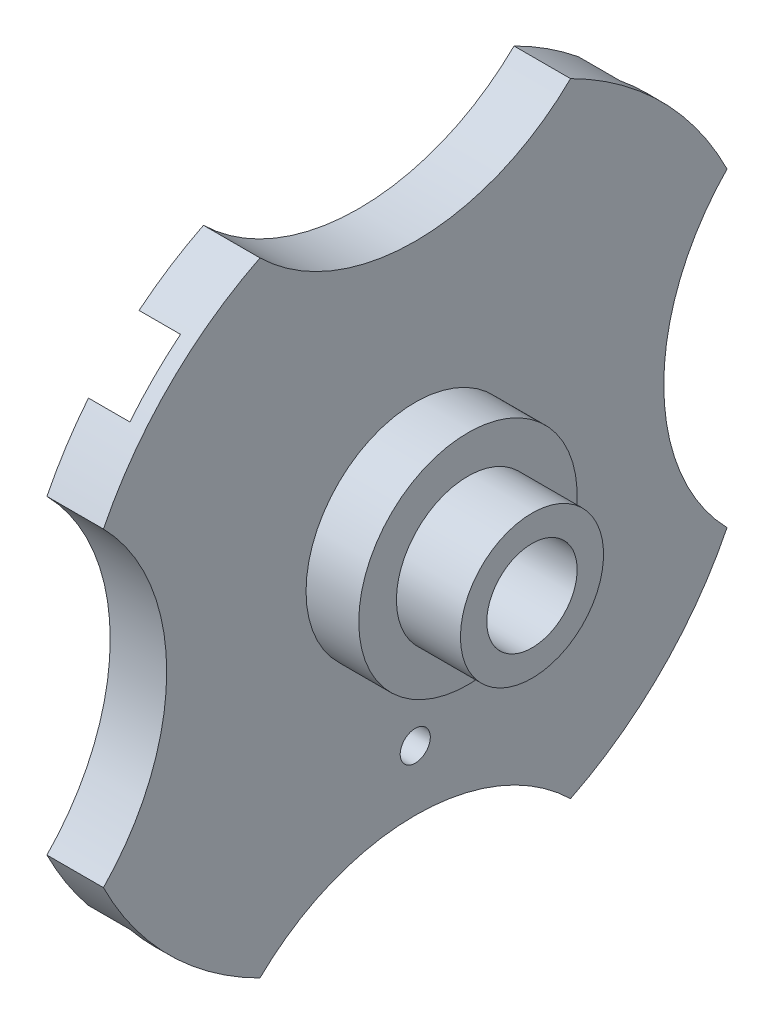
ISO-10303-21;
HEADER;
FILE_DESCRIPTION(('STEP AP214'),'2;1');
FILE_NAME('part.step','',(''),(''),'','','');
FILE_SCHEMA(('AUTOMOTIVE_DESIGN { 1 0 10303 214 1 1 1 1 }'));
ENDSEC;
DATA;
#1=APPLICATION_CONTEXT('core data for automotive mechanical design processes');
#2=APPLICATION_PROTOCOL_DEFINITION('international standard','automotive_design',2000,#1);
#3=PRODUCT_CONTEXT('',#1,'mechanical');
#4=PRODUCT('Part','Part','',(#3));
#5=PRODUCT_RELATED_PRODUCT_CATEGORY('part','',(#4));
#6=PRODUCT_DEFINITION_FORMATION('','',#4);
#7=PRODUCT_DEFINITION_CONTEXT('part definition',#1,'design');
#8=PRODUCT_DEFINITION('design','',#6,#7);
#9=PRODUCT_DEFINITION_SHAPE('','',#8);
#10=(LENGTH_UNIT() NAMED_UNIT(*) SI_UNIT(.MILLI.,.METRE.));
#11=(NAMED_UNIT(*) PLANE_ANGLE_UNIT() SI_UNIT($,.RADIAN.));
#12=(NAMED_UNIT(*) SI_UNIT($,.STERADIAN.) SOLID_ANGLE_UNIT());
#13=UNCERTAINTY_MEASURE_WITH_UNIT(LENGTH_MEASURE(1.E-05),#10,'distance_accuracy_value','');
#14=(GEOMETRIC_REPRESENTATION_CONTEXT(3) GLOBAL_UNCERTAINTY_ASSIGNED_CONTEXT((#13)) GLOBAL_UNIT_ASSIGNED_CONTEXT((#10,
#11,#12)) REPRESENTATION_CONTEXT('',''));
#15=CARTESIAN_POINT('',(0.,0.,0.));
#16=DIRECTION('',(0.,0.,1.));
#17=DIRECTION('',(1.,0.,0.));
#18=AXIS2_PLACEMENT_3D('',#15,#16,#17);
#19=CARTESIAN_POINT('',(0.,0.,0.));
#20=DIRECTION('',(-1.,0.,0.));
#21=DIRECTION('',(0.,0.,1.));
#22=AXIS2_PLACEMENT_3D('',#19,#20,#21);
#23=CYLINDRICAL_SURFACE('',#22,92.5);
#24=CARTESIAN_POINT('',(11.,0.,0.));
#25=DIRECTION('',(-1.,0.,0.));
#26=DIRECTION('',(0.,0.,1.));
#27=AXIS2_PLACEMENT_3D('',#24,#25,#26);
#28=CIRCLE('',#27,92.5);
#29=CARTESIAN_POINT('',(11.,-58.3439949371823,-71.779023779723));
#30=VERTEX_POINT('',#29);
#31=CARTESIAN_POINT('',(11.,-71.7790237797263,-58.3439949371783));
#32=VERTEX_POINT('',#31);
#33=EDGE_CURVE('E199',#30,#32,#28,.T.);
#34=ORIENTED_EDGE('',*,*,#33,.F.);
#35=DIRECTION('',(-1.,0.,0.));
#36=VECTOR('',#35,1.);
#37=CARTESIAN_POINT('',(0.,-58.3439949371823,-71.779023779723));
#38=LINE('',#37,#36);
#39=CARTESIAN_POINT('',(0.,-58.3439949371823,-71.779023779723));
#40=VERTEX_POINT('',#39);
#41=EDGE_CURVE('E250',#30,#40,#38,.T.);
#42=ORIENTED_EDGE('',*,*,#41,.T.);
#43=CARTESIAN_POINT('',(0.,0.,0.));
#44=DIRECTION('',(-1.,0.,0.));
#45=DIRECTION('',(0.,0.,1.));
#46=AXIS2_PLACEMENT_3D('',#43,#44,#45);
#47=CIRCLE('',#46,92.5);
#48=CARTESIAN_POINT('',(0.,-41.2340199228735,-82.8010000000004));
#49=VERTEX_POINT('',#48);
#50=EDGE_CURVE('E407',#49,#40,#47,.T.);
#51=ORIENTED_EDGE('',*,*,#50,.F.);
#52=DIRECTION('',(-1.,0.,0.));
#53=VECTOR('',#52,1.);
#54=CARTESIAN_POINT('',(23.,-41.2340199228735,-82.8010000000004));
#55=LINE('',#54,#53);
#56=CARTESIAN_POINT('',(15.,-41.2340199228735,-82.8010000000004));
#57=VERTEX_POINT('',#56);
#58=EDGE_CURVE('E312',#49,#57,#55,.F.);
#59=ORIENTED_EDGE('',*,*,#58,.T.);
#60=CARTESIAN_POINT('',(15.,0.,0.));
#61=DIRECTION('',(-1.,0.,0.));
#62=DIRECTION('',(0.,0.,1.));
#63=AXIS2_PLACEMENT_3D('',#60,#61,#62);
#64=CIRCLE('',#63,92.5);
#65=CARTESIAN_POINT('',(15.,-82.8009999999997,-41.2340199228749));
#66=VERTEX_POINT('',#65);
#67=EDGE_CURVE('E385',#57,#66,#64,.T.);
#68=ORIENTED_EDGE('',*,*,#67,.T.);
#69=DIRECTION('',(-1.,0.,0.));
#70=VECTOR('',#69,1.);
#71=CARTESIAN_POINT('',(23.,-82.8009999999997,-41.2340199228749));
#72=LINE('',#71,#70);
#73=CARTESIAN_POINT('',(0.,-82.8009999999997,-41.2340199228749));
#74=VERTEX_POINT('',#73);
#75=EDGE_CURVE('E321',#66,#74,#72,.T.);
#76=ORIENTED_EDGE('',*,*,#75,.T.);
#77=CARTESIAN_POINT('',(0.,-71.7790237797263,-58.3439949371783));
#78=VERTEX_POINT('',#77);
#79=EDGE_CURVE('E404',#78,#74,#47,.T.);
#80=ORIENTED_EDGE('',*,*,#79,.F.);
#81=DIRECTION('',(-1.,0.,0.));
#82=VECTOR('',#81,1.);
#83=CARTESIAN_POINT('',(0.,-71.7790237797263,-58.3439949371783));
#84=LINE('',#83,#82);
#85=EDGE_CURVE('E55',#78,#32,#84,.F.);
#86=ORIENTED_EDGE('',*,*,#85,.T.);
#87=EDGE_LOOP('',(#34,#42,#51,#59,#68,#76,#80,#86));
#88=FACE_BOUND('',#87,.T.);
#89=ADVANCED_FACE('F32',(#88),#23,.T.);
#90=CARTESIAN_POINT('',(11.,0.,0.));
#91=DIRECTION('',(-1.,0.,0.));
#92=DIRECTION('',(0.,0.,1.));
#93=AXIS2_PLACEMENT_3D('',#90,#91,#92);
#94=CIRCLE('',#93,92.5);
#95=CARTESIAN_POINT('',(11.,-71.7803426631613,58.3423723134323));
#96=VERTEX_POINT('',#95);
#97=CARTESIAN_POINT('',(11.,-58.3456175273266,71.7777048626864));
#98=VERTEX_POINT('',#97);
#99=EDGE_CURVE('E391',#96,#98,#94,.T.);
#100=ORIENTED_EDGE('',*,*,#99,.F.);
#101=DIRECTION('',(-1.,0.,0.));
#102=VECTOR('',#101,1.);
#103=CARTESIAN_POINT('',(0.,-71.7803426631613,58.3423723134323));
#104=LINE('',#103,#102);
#105=CARTESIAN_POINT('',(0.,-71.7803426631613,58.3423723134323));
#106=VERTEX_POINT('',#105);
#107=EDGE_CURVE('E274',#96,#106,#104,.T.);
#108=ORIENTED_EDGE('',*,*,#107,.T.);
#109=CARTESIAN_POINT('',(0.,-82.8010000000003,41.2340199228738));
#110=VERTEX_POINT('',#109);
#111=EDGE_CURVE('E408',#110,#106,#47,.T.);
#112=ORIENTED_EDGE('',*,*,#111,.F.);
#113=DIRECTION('',(-1.,0.,0.));
#114=VECTOR('',#113,1.);
#115=CARTESIAN_POINT('',(23.,-82.8010000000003,41.2340199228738));
#116=LINE('',#115,#114);
#117=CARTESIAN_POINT('',(15.,-82.8010000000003,41.2340199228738));
#118=VERTEX_POINT('',#117);
#119=EDGE_CURVE('E324',#110,#118,#116,.F.);
#120=ORIENTED_EDGE('',*,*,#119,.T.);
#121=CARTESIAN_POINT('',(15.,-41.2340199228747,82.8009999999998));
#122=VERTEX_POINT('',#121);
#123=EDGE_CURVE('E479',#118,#122,#64,.T.);
#124=ORIENTED_EDGE('',*,*,#123,.T.);
#125=DIRECTION('',(-1.,0.,0.));
#126=VECTOR('',#125,1.);
#127=CARTESIAN_POINT('',(23.,-41.2340199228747,82.8009999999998));
#128=LINE('',#127,#126);
#129=CARTESIAN_POINT('',(0.,-41.2340199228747,82.8009999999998));
#130=VERTEX_POINT('',#129);
#131=EDGE_CURVE('E333',#122,#130,#128,.T.);
#132=ORIENTED_EDGE('',*,*,#131,.T.);
#133=CARTESIAN_POINT('',(0.,-58.3456175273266,71.7777048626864));
#134=VERTEX_POINT('',#133);
#135=EDGE_CURVE('E409',#134,#130,#47,.T.);
#136=ORIENTED_EDGE('',*,*,#135,.F.);
#137=DIRECTION('',(-1.,0.,0.));
#138=VECTOR('',#137,1.);
#139=CARTESIAN_POINT('',(0.,-58.3456175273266,71.7777048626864));
#140=LINE('',#139,#138);
#141=EDGE_CURVE('E269',#134,#98,#140,.F.);
#142=ORIENTED_EDGE('',*,*,#141,.T.);
#143=EDGE_LOOP('',(#100,#108,#112,#120,#124,#132,#136,#142));
#144=FACE_BOUND('',#143,.T.);
#145=ADVANCED_FACE('F444',(#144),#23,.T.);
#146=CARTESIAN_POINT('',(11.,0.,0.));
#147=DIRECTION('',(-1.,0.,0.));
#148=DIRECTION('',(0.,0.,1.));
#149=AXIS2_PLACEMENT_3D('',#146,#147,#148);
#150=CIRCLE('',#149,92.5);
#151=CARTESIAN_POINT('',(11.,58.3439949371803,71.7790237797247));
#152=VERTEX_POINT('',#151);
#153=CARTESIAN_POINT('',(11.,71.7790237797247,58.3439949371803));
#154=VERTEX_POINT('',#153);
#155=EDGE_CURVE('E285',#152,#154,#150,.T.);
#156=ORIENTED_EDGE('',*,*,#155,.F.);
#157=DIRECTION('',(-1.,0.,0.));
#158=VECTOR('',#157,1.);
#159=CARTESIAN_POINT('',(11.,58.3439949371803,71.7790237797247));
#160=LINE('',#159,#158);
#161=CARTESIAN_POINT('',(0.,58.3439949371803,71.7790237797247));
#162=VERTEX_POINT('',#161);
#163=EDGE_CURVE('E298',#152,#162,#160,.T.);
#164=ORIENTED_EDGE('',*,*,#163,.T.);
#165=CARTESIAN_POINT('',(0.,41.2340199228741,82.8010000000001));
#166=VERTEX_POINT('',#165);
#167=EDGE_CURVE('E356',#166,#162,#47,.T.);
#168=ORIENTED_EDGE('',*,*,#167,.F.);
#169=DIRECTION('',(-1.,0.,0.));
#170=VECTOR('',#169,1.);
#171=CARTESIAN_POINT('',(23.,41.2340199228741,82.8010000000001));
#172=LINE('',#171,#170);
#173=CARTESIAN_POINT('',(15.,41.2340199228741,82.8010000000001));
#174=VERTEX_POINT('',#173);
#175=EDGE_CURVE('E336',#166,#174,#172,.F.);
#176=ORIENTED_EDGE('',*,*,#175,.T.);
#177=CARTESIAN_POINT('',(15.,82.801,41.2340199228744));
#178=VERTEX_POINT('',#177);
#179=EDGE_CURVE('E380',#174,#178,#64,.T.);
#180=ORIENTED_EDGE('',*,*,#179,.T.);
#181=DIRECTION('',(-1.,0.,0.));
#182=VECTOR('',#181,1.);
#183=CARTESIAN_POINT('',(23.,82.801,41.2340199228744));
#184=LINE('',#183,#182);
#185=CARTESIAN_POINT('',(0.,82.801,41.2340199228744));
#186=VERTEX_POINT('',#185);
#187=EDGE_CURVE('E345',#178,#186,#184,.T.);
#188=ORIENTED_EDGE('',*,*,#187,.T.);
#189=CARTESIAN_POINT('',(0.,71.7790237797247,58.3439949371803));
#190=VERTEX_POINT('',#189);
#191=EDGE_CURVE('E351',#190,#186,#47,.T.);
#192=ORIENTED_EDGE('',*,*,#191,.F.);
#193=DIRECTION('',(-1.,0.,0.));
#194=VECTOR('',#193,1.);
#195=CARTESIAN_POINT('',(11.,71.7790237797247,58.3439949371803));
#196=LINE('',#195,#194);
#197=EDGE_CURVE('E297',#154,#190,#196,.T.);
#198=ORIENTED_EDGE('',*,*,#197,.F.);
#199=EDGE_LOOP('',(#156,#164,#168,#176,#180,#188,#192,#198));
#200=FACE_BOUND('',#199,.T.);
#201=ADVANCED_FACE('F448',(#200),#23,.T.);
#202=CARTESIAN_POINT('',(11.,0.,0.));
#203=DIRECTION('',(-1.,0.,0.));
#204=DIRECTION('',(0.,0.,1.));
#205=AXIS2_PLACEMENT_3D('',#202,#203,#204);
#206=CIRCLE('',#205,92.5);
#207=CARTESIAN_POINT('',(11.,71.7777048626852,-58.3456175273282));
#208=VERTEX_POINT('',#207);
#209=CARTESIAN_POINT('',(11.,58.3423723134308,-71.7803426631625));
#210=VERTEX_POINT('',#209);
#211=EDGE_CURVE('E11',#208,#210,#206,.T.);
#212=ORIENTED_EDGE('',*,*,#211,.F.);
#213=DIRECTION('',(-1.,0.,0.));
#214=VECTOR('',#213,1.);
#215=CARTESIAN_POINT('',(0.,71.7777048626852,-58.3456175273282));
#216=LINE('',#215,#214);
#217=CARTESIAN_POINT('',(0.,71.7777048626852,-58.3456175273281));
#218=VERTEX_POINT('',#217);
#219=EDGE_CURVE('E228',#208,#218,#216,.T.);
#220=ORIENTED_EDGE('',*,*,#219,.T.);
#221=CARTESIAN_POINT('',(0.,82.801,-41.2340199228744));
#222=VERTEX_POINT('',#221);
#223=EDGE_CURVE('E352',#222,#218,#47,.T.);
#224=ORIENTED_EDGE('',*,*,#223,.F.);
#225=DIRECTION('',(-1.,0.,0.));
#226=VECTOR('',#225,1.);
#227=CARTESIAN_POINT('',(23.,82.801,-41.2340199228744));
#228=LINE('',#227,#226);
#229=CARTESIAN_POINT('',(15.,82.801,-41.2340199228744));
#230=VERTEX_POINT('',#229);
#231=EDGE_CURVE('E348',#222,#230,#228,.F.);
#232=ORIENTED_EDGE('',*,*,#231,.T.);
#233=CARTESIAN_POINT('',(15.,41.2340199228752,-82.8009999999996));
#234=VERTEX_POINT('',#233);
#235=EDGE_CURVE('E381',#230,#234,#64,.T.);
#236=ORIENTED_EDGE('',*,*,#235,.T.);
#237=DIRECTION('',(-1.,0.,0.));
#238=VECTOR('',#237,1.);
#239=CARTESIAN_POINT('',(23.,41.2340199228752,-82.8009999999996));
#240=LINE('',#239,#238);
#241=CARTESIAN_POINT('',(0.,41.2340199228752,-82.8009999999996));
#242=VERTEX_POINT('',#241);
#243=EDGE_CURVE('E309',#234,#242,#240,.T.);
#244=ORIENTED_EDGE('',*,*,#243,.T.);
#245=CARTESIAN_POINT('',(0.,58.3423723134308,-71.7803426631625));
#246=VERTEX_POINT('',#245);
#247=EDGE_CURVE('E355',#246,#242,#47,.T.);
#248=ORIENTED_EDGE('',*,*,#247,.F.);
#249=DIRECTION('',(-1.,0.,0.));
#250=VECTOR('',#249,1.);
#251=CARTESIAN_POINT('',(0.,58.3423723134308,-71.7803426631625));
#252=LINE('',#251,#250);
#253=EDGE_CURVE('E47',#246,#210,#252,.F.);
#254=ORIENTED_EDGE('',*,*,#253,.T.);
#255=EDGE_LOOP('',(#212,#220,#224,#232,#236,#244,#248,#254));
#256=FACE_BOUND('',#255,.T.);
#257=ADVANCED_FACE('F34',(#256),#23,.T.);
#258=CARTESIAN_POINT('',(15.,92.5,0.));
#259=DIRECTION('',(-1.,0.,0.));
#260=DIRECTION('',(0.,0.,1.));
#261=AXIS2_PLACEMENT_3D('',#258,#259,#260);
#262=PLANE('',#261);
#263=CARTESIAN_POINT('',(15.,-50.,0.));
#264=DIRECTION('',(-1.,0.,0.));
#265=DIRECTION('',(0.,0.,1.));
#266=AXIS2_PLACEMENT_3D('',#263,#264,#265);
#267=CIRCLE('',#266,4.00000000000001);
#268=CARTESIAN_POINT('',(15.,-50.,4.00000000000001));
#269=VERTEX_POINT('',#268);
#270=EDGE_CURVE('E213',#269,#269,#267,.T.);
#271=ORIENTED_EDGE('',*,*,#270,.T.);
#272=EDGE_LOOP('',(#271));
#273=FACE_BOUND('',#272,.T.);
#274=ORIENTED_EDGE('',*,*,#67,.F.);
#275=CARTESIAN_POINT('',(15.,1.30930626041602E-12,-125.));
#276=DIRECTION('',(-1.,0.,0.));
#277=DIRECTION('',(0.,0.,1.));
#278=AXIS2_PLACEMENT_3D('',#275,#276,#277);
#279=CIRCLE('',#278,59.);
#280=EDGE_CURVE('E301',#57,#234,#279,.T.);
#281=ORIENTED_EDGE('',*,*,#280,.T.);
#282=ORIENTED_EDGE('',*,*,#235,.F.);
#283=CARTESIAN_POINT('',(15.,125.,0.));
#284=DIRECTION('',(-1.,0.,0.));
#285=DIRECTION('',(0.,0.,1.));
#286=AXIS2_PLACEMENT_3D('',#283,#284,#285);
#287=CIRCLE('',#286,59.);
#288=EDGE_CURVE('E342',#230,#178,#287,.T.);
#289=ORIENTED_EDGE('',*,*,#288,.T.);
#290=ORIENTED_EDGE('',*,*,#179,.F.);
#291=CARTESIAN_POINT('',(15.,-4.36435420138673E-13,125.));
#292=DIRECTION('',(-1.,0.,0.));
#293=DIRECTION('',(0.,0.,1.));
#294=AXIS2_PLACEMENT_3D('',#291,#292,#293);
#295=CIRCLE('',#294,59.);
#296=EDGE_CURVE('E330',#174,#122,#295,.T.);
#297=ORIENTED_EDGE('',*,*,#296,.T.);
#298=ORIENTED_EDGE('',*,*,#123,.F.);
#299=CARTESIAN_POINT('',(15.,-125.,-8.72870840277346E-13));
#300=DIRECTION('',(-1.,0.,0.));
#301=DIRECTION('',(0.,0.,1.));
#302=AXIS2_PLACEMENT_3D('',#299,#300,#301);
#303=CIRCLE('',#302,59.);
#304=EDGE_CURVE('E318',#118,#66,#303,.T.);
#305=ORIENTED_EDGE('',*,*,#304,.T.);
#306=EDGE_LOOP('',(#274,#281,#282,#289,#290,#297,#298,#305));
#307=FACE_BOUND('',#306,.T.);
#308=CARTESIAN_POINT('',(15.,0.,0.));
#309=DIRECTION('',(-1.,0.,0.));
#310=DIRECTION('',(0.,0.,1.));
#311=AXIS2_PLACEMENT_3D('',#308,#309,#310);
#312=CIRCLE('',#311,29.);
#313=CARTESIAN_POINT('',(15.,0.,29.));
#314=VERTEX_POINT('',#313);
#315=EDGE_CURVE('E377',#314,#314,#312,.T.);
#316=ORIENTED_EDGE('',*,*,#315,.T.);
#317=EDGE_LOOP('',(#316));
#318=FACE_BOUND('',#317,.T.);
#319=ADVANCED_FACE('F422',(#273,#307,#318),#262,.F.);
#320=CARTESIAN_POINT('',(0.,0.,0.));
#321=DIRECTION('',(-1.,0.,0.));
#322=DIRECTION('',(0.,0.,1.));
#323=AXIS2_PLACEMENT_3D('',#320,#321,#322);
#324=CYLINDRICAL_SURFACE('',#323,29.);
#325=ORIENTED_EDGE('',*,*,#315,.F.);
#326=EDGE_LOOP('',(#325));
#327=FACE_BOUND('',#326,.T.);
#328=CARTESIAN_POINT('',(29.,0.,0.));
#329=DIRECTION('',(-1.,0.,0.));
#330=DIRECTION('',(0.,0.,1.));
#331=AXIS2_PLACEMENT_3D('',#328,#329,#330);
#332=CIRCLE('',#331,29.);
#333=CARTESIAN_POINT('',(29.,0.,29.));
#334=VERTEX_POINT('',#333);
#335=EDGE_CURVE('E374',#334,#334,#332,.T.);
#336=ORIENTED_EDGE('',*,*,#335,.T.);
#337=EDGE_LOOP('',(#336));
#338=FACE_BOUND('',#337,.T.);
#339=ADVANCED_FACE('F455',(#327,#338),#324,.T.);
#340=CARTESIAN_POINT('',(29.,29.,0.));
#341=DIRECTION('',(-1.,0.,0.));
#342=DIRECTION('',(0.,0.,1.));
#343=AXIS2_PLACEMENT_3D('',#340,#341,#342);
#344=PLANE('',#343);
#345=ORIENTED_EDGE('',*,*,#335,.F.);
#346=EDGE_LOOP('',(#345));
#347=FACE_BOUND('',#346,.T.);
#348=CARTESIAN_POINT('',(29.,0.,0.));
#349=DIRECTION('',(-1.,0.,0.));
#350=DIRECTION('',(0.,0.,1.));
#351=AXIS2_PLACEMENT_3D('',#348,#349,#350);
#352=CIRCLE('',#351,19.);
#353=CARTESIAN_POINT('',(29.,0.,19.));
#354=VERTEX_POINT('',#353);
#355=EDGE_CURVE('E371',#354,#354,#352,.T.);
#356=ORIENTED_EDGE('',*,*,#355,.T.);
#357=EDGE_LOOP('',(#356));
#358=FACE_BOUND('',#357,.T.);
#359=ADVANCED_FACE('F521',(#347,#358),#344,.F.);
#360=CARTESIAN_POINT('',(0.,0.,0.));
#361=DIRECTION('',(-1.,0.,0.));
#362=DIRECTION('',(0.,0.,1.));
#363=AXIS2_PLACEMENT_3D('',#360,#361,#362);
#364=CYLINDRICAL_SURFACE('',#363,19.);
#365=ORIENTED_EDGE('',*,*,#355,.F.);
#366=EDGE_LOOP('',(#365));
#367=FACE_BOUND('',#366,.T.);
#368=CARTESIAN_POINT('',(46.,0.,0.));
#369=DIRECTION('',(-1.,0.,0.));
#370=DIRECTION('',(0.,0.,1.));
#371=AXIS2_PLACEMENT_3D('',#368,#369,#370);
#372=CIRCLE('',#371,19.);
#373=CARTESIAN_POINT('',(46.,0.,19.));
#374=VERTEX_POINT('',#373);
#375=EDGE_CURVE('E368',#374,#374,#372,.T.);
#376=ORIENTED_EDGE('',*,*,#375,.T.);
#377=EDGE_LOOP('',(#376));
#378=FACE_BOUND('',#377,.T.);
#379=ADVANCED_FACE('F517',(#367,#378),#364,.T.);
#380=CARTESIAN_POINT('',(46.,19.,0.));
#381=DIRECTION('',(-1.,0.,0.));
#382=DIRECTION('',(0.,0.,1.));
#383=AXIS2_PLACEMENT_3D('',#380,#381,#382);
#384=PLANE('',#383);
#385=ORIENTED_EDGE('',*,*,#375,.F.);
#386=EDGE_LOOP('',(#385));
#387=FACE_BOUND('',#386,.T.);
#388=CARTESIAN_POINT('',(46.,0.,0.));
#389=DIRECTION('',(-1.,0.,0.));
#390=DIRECTION('',(0.,0.,1.));
#391=AXIS2_PLACEMENT_3D('',#388,#389,#390);
#392=CIRCLE('',#391,12.);
#393=CARTESIAN_POINT('',(46.,0.,12.));
#394=VERTEX_POINT('',#393);
#395=EDGE_CURVE('E365',#394,#394,#392,.T.);
#396=ORIENTED_EDGE('',*,*,#395,.T.);
#397=EDGE_LOOP('',(#396));
#398=FACE_BOUND('',#397,.T.);
#399=ADVANCED_FACE('F513',(#387,#398),#384,.F.);
#400=CARTESIAN_POINT('',(0.,0.,0.));
#401=DIRECTION('',(-1.,0.,0.));
#402=DIRECTION('',(0.,0.,1.));
#403=AXIS2_PLACEMENT_3D('',#400,#401,#402);
#404=CYLINDRICAL_SURFACE('',#403,12.);
#405=ORIENTED_EDGE('',*,*,#395,.F.);
#406=EDGE_LOOP('',(#405));
#407=FACE_BOUND('',#406,.T.);
#408=CARTESIAN_POINT('',(17.,0.,0.));
#409=DIRECTION('',(-1.,0.,0.));
#410=DIRECTION('',(0.,0.,1.));
#411=AXIS2_PLACEMENT_3D('',#408,#409,#410);
#412=CIRCLE('',#411,12.);
#413=CARTESIAN_POINT('',(17.,0.,12.));
#414=VERTEX_POINT('',#413);
#415=EDGE_CURVE('E362',#414,#414,#412,.T.);
#416=ORIENTED_EDGE('',*,*,#415,.T.);
#417=EDGE_LOOP('',(#416));
#418=FACE_BOUND('',#417,.T.);
#419=ADVANCED_FACE('F509',(#407,#418),#404,.F.);
#420=CARTESIAN_POINT('',(17.,24.,0.));
#421=DIRECTION('',(1.,0.,0.));
#422=DIRECTION('',(0.,0.,-1.));
#423=AXIS2_PLACEMENT_3D('',#420,#421,#422);
#424=PLANE('',#423);
#425=ORIENTED_EDGE('',*,*,#415,.F.);
#426=EDGE_LOOP('',(#425));
#427=FACE_BOUND('',#426,.T.);
#428=CARTESIAN_POINT('',(17.,0.,0.));
#429=DIRECTION('',(-1.,0.,0.));
#430=DIRECTION('',(0.,0.,1.));
#431=AXIS2_PLACEMENT_3D('',#428,#429,#430);
#432=CIRCLE('',#431,24.);
#433=CARTESIAN_POINT('',(17.,0.,24.));
#434=VERTEX_POINT('',#433);
#435=EDGE_CURVE('E359',#434,#434,#432,.T.);
#436=ORIENTED_EDGE('',*,*,#435,.T.);
#437=EDGE_LOOP('',(#436));
#438=FACE_BOUND('',#437,.T.);
#439=ADVANCED_FACE('F505',(#427,#438),#424,.F.);
#440=CARTESIAN_POINT('',(0.,0.,0.));
#441=DIRECTION('',(-1.,0.,0.));
#442=DIRECTION('',(0.,0.,1.));
#443=AXIS2_PLACEMENT_3D('',#440,#441,#442);
#444=CYLINDRICAL_SURFACE('',#443,24.);
#445=ORIENTED_EDGE('',*,*,#435,.F.);
#446=EDGE_LOOP('',(#445));
#447=FACE_BOUND('',#446,.T.);
#448=CARTESIAN_POINT('',(0.,0.,0.));
#449=DIRECTION('',(-1.,0.,0.));
#450=DIRECTION('',(0.,0.,1.));
#451=AXIS2_PLACEMENT_3D('',#448,#449,#450);
#452=CIRCLE('',#451,24.);
#453=CARTESIAN_POINT('',(0.,0.,24.));
#454=VERTEX_POINT('',#453);
#455=EDGE_CURVE('E354',#454,#454,#452,.T.);
#456=ORIENTED_EDGE('',*,*,#455,.T.);
#457=EDGE_LOOP('',(#456));
#458=FACE_BOUND('',#457,.T.);
#459=ADVANCED_FACE('F501',(#447,#458),#444,.F.);
#460=CARTESIAN_POINT('',(0.,24.,0.));
#461=DIRECTION('',(1.,0.,0.));
#462=DIRECTION('',(0.,0.,-1.));
#463=AXIS2_PLACEMENT_3D('',#460,#461,#462);
#464=PLANE('',#463);
#465=CARTESIAN_POINT('',(0.,-50.,0.));
#466=DIRECTION('',(-1.,0.,0.));
#467=DIRECTION('',(0.,0.,1.));
#468=AXIS2_PLACEMENT_3D('',#465,#466,#467);
#469=CIRCLE('',#468,4.00000000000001);
#470=CARTESIAN_POINT('',(0.,-50.,4.00000000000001));
#471=VERTEX_POINT('',#470);
#472=EDGE_CURVE('E218',#471,#471,#469,.T.);
#473=ORIENTED_EDGE('',*,*,#472,.F.);
#474=EDGE_LOOP('',(#473));
#475=FACE_BOUND('',#474,.T.);
#476=ORIENTED_EDGE('',*,*,#455,.F.);
#477=EDGE_LOOP('',(#476));
#478=FACE_BOUND('',#477,.T.);
#479=ORIENTED_EDGE('',*,*,#223,.T.);
#480=DIRECTION('',(0.,0.70710678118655,-0.707106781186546));
#481=VECTOR('',#480,1.);
#482=CARTESIAN_POINT('',(0.,32.1733585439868,-18.74127120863));
#483=LINE('',#482,#481);
#484=CARTESIAN_POINT('',(0.,32.1733585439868,-18.7412712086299));
#485=VERTEX_POINT('',#484);
#486=EDGE_CURVE('E212',#485,#218,#483,.T.);
#487=ORIENTED_EDGE('',*,*,#486,.F.);
#488=CARTESIAN_POINT('',(0.,25.4558441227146,-25.4587856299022));
#489=DIRECTION('',(-1.,0.,0.));
#490=DIRECTION('',(0.,0.,1.));
#491=AXIS2_PLACEMENT_3D('',#488,#489,#490);
#492=CIRCLE('',#491,9.5);
#493=CARTESIAN_POINT('',(0.,18.7383297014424,-32.1763000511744));
#494=VERTEX_POINT('',#493);
#495=EDGE_CURVE('E203',#494,#485,#492,.T.);
#496=ORIENTED_EDGE('',*,*,#495,.F.);
#497=DIRECTION('',(0.,0.70710678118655,-0.707106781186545));
#498=VECTOR('',#497,1.);
#499=CARTESIAN_POINT('',(0.,5.28101482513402,-18.7189851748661));
#500=LINE('',#499,#498);
#501=EDGE_CURVE('E40',#494,#246,#500,.T.);
#502=ORIENTED_EDGE('',*,*,#501,.T.);
#503=ORIENTED_EDGE('',*,*,#247,.T.);
#504=CARTESIAN_POINT('',(0.,1.30930626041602E-12,-125.));
#505=DIRECTION('',(1.,0.,0.));
#506=DIRECTION('',(0.,0.,-1.));
#507=AXIS2_PLACEMENT_3D('',#504,#505,#506);
#508=CIRCLE('',#507,59.);
#509=EDGE_CURVE('E384',#242,#49,#508,.T.);
#510=ORIENTED_EDGE('',*,*,#509,.T.);
#511=ORIENTED_EDGE('',*,*,#50,.T.);
#512=DIRECTION('',(0.,-0.70710678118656,-0.707106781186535));
#513=VECTOR('',#512,1.);
#514=CARTESIAN_POINT('',(0.,-18.7412712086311,-32.1763000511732));
#515=LINE('',#514,#513);
#516=CARTESIAN_POINT('',(0.,-18.7412712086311,-32.1763000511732));
#517=VERTEX_POINT('',#516);
#518=EDGE_CURVE('E234',#517,#40,#515,.T.);
#519=ORIENTED_EDGE('',*,*,#518,.F.);
#520=CARTESIAN_POINT('',(0.,-25.4587856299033,-25.458785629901));
#521=DIRECTION('',(-1.,0.,0.));
#522=DIRECTION('',(0.,0.,1.));
#523=AXIS2_PLACEMENT_3D('',#520,#521,#522);
#524=CIRCLE('',#523,9.5);
#525=CARTESIAN_POINT('',(0.,-32.1763000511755,-18.7412712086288));
#526=VERTEX_POINT('',#525);
#527=EDGE_CURVE('E231',#526,#517,#524,.T.);
#528=ORIENTED_EDGE('',*,*,#527,.F.);
#529=DIRECTION('',(0.,-0.70710678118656,-0.707106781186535));
#530=VECTOR('',#529,1.);
#531=CARTESIAN_POINT('',(0.,5.28248557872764,18.717514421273));
#532=LINE('',#531,#530);
#533=EDGE_CURVE('E393',#526,#78,#532,.T.);
#534=ORIENTED_EDGE('',*,*,#533,.T.);
#535=ORIENTED_EDGE('',*,*,#79,.T.);
#536=CARTESIAN_POINT('',(0.,-125.,-8.72870840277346E-13));
#537=DIRECTION('',(-1.,0.,0.));
#538=DIRECTION('',(0.,0.,1.));
#539=AXIS2_PLACEMENT_3D('',#536,#537,#538);
#540=CIRCLE('',#539,59.);
#541=EDGE_CURVE('E315',#110,#74,#540,.T.);
#542=ORIENTED_EDGE('',*,*,#541,.F.);
#543=ORIENTED_EDGE('',*,*,#111,.T.);
#544=DIRECTION('',(0.,-0.707106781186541,0.707106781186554));
#545=VECTOR('',#544,1.);
#546=CARTESIAN_POINT('',(0.,-32.1763000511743,18.7383297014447));
#547=LINE('',#546,#545);
#548=CARTESIAN_POINT('',(0.,-32.1763000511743,18.7383297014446));
#549=VERTEX_POINT('',#548);
#550=EDGE_CURVE('E256',#549,#106,#547,.T.);
#551=ORIENTED_EDGE('',*,*,#550,.F.);
#552=CARTESIAN_POINT('',(0.,-25.4587856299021,25.4558441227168));
#553=DIRECTION('',(-1.,0.,0.));
#554=DIRECTION('',(0.,0.,1.));
#555=AXIS2_PLACEMENT_3D('',#552,#553,#554);
#556=CIRCLE('',#555,9.5);
#557=CARTESIAN_POINT('',(0.,-18.7412712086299,32.1733585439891));
#558=VERTEX_POINT('',#557);
#559=EDGE_CURVE('E253',#558,#549,#556,.T.);
#560=ORIENTED_EDGE('',*,*,#559,.F.);
#561=DIRECTION('',(0.,-0.707106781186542,0.707106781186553));
#562=VECTOR('',#561,1.);
#563=CARTESIAN_POINT('',(0.,18.7160436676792,-5.28395633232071));
#564=LINE('',#563,#562);
#565=EDGE_CURVE('E388',#558,#134,#564,.T.);
#566=ORIENTED_EDGE('',*,*,#565,.T.);
#567=ORIENTED_EDGE('',*,*,#135,.T.);
#568=CARTESIAN_POINT('',(0.,-4.36435420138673E-13,125.));
#569=DIRECTION('',(-1.,0.,0.));
#570=DIRECTION('',(0.,0.,1.));
#571=AXIS2_PLACEMENT_3D('',#568,#569,#570);
#572=CIRCLE('',#571,59.);
#573=EDGE_CURVE('E327',#166,#130,#572,.T.);
#574=ORIENTED_EDGE('',*,*,#573,.F.);
#575=ORIENTED_EDGE('',*,*,#167,.T.);
#576=DIRECTION('',(0.,0.707106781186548,0.707106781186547));
#577=VECTOR('',#576,1.);
#578=CARTESIAN_POINT('',(0.,18.7383297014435,32.1733585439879));
#579=LINE('',#578,#577);
#580=CARTESIAN_POINT('',(0.,18.7383297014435,32.1733585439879));
#581=VERTEX_POINT('',#580);
#582=EDGE_CURVE('E283',#581,#162,#579,.T.);
#583=ORIENTED_EDGE('',*,*,#582,.F.);
#584=CARTESIAN_POINT('',(0.,25.4558441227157,25.4558441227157));
#585=DIRECTION('',(-1.,0.,0.));
#586=DIRECTION('',(0.,0.,1.));
#587=AXIS2_PLACEMENT_3D('',#584,#585,#586);
#588=CIRCLE('',#587,9.5);
#589=CARTESIAN_POINT('',(0.,32.1733585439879,18.7383297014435));
#590=VERTEX_POINT('',#589);
#591=EDGE_CURVE('E280',#590,#581,#588,.T.);
#592=ORIENTED_EDGE('',*,*,#591,.F.);
#593=DIRECTION('',(0.,-0.707106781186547,-0.707106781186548));
#594=VECTOR('',#593,1.);
#595=CARTESIAN_POINT('',(0.,32.1733585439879,18.7383297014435));
#596=LINE('',#595,#594);
#597=EDGE_CURVE('E277',#190,#590,#596,.T.);
#598=ORIENTED_EDGE('',*,*,#597,.F.);
#599=ORIENTED_EDGE('',*,*,#191,.T.);
#600=CARTESIAN_POINT('',(0.,125.,0.));
#601=DIRECTION('',(-1.,0.,0.));
#602=DIRECTION('',(0.,0.,1.));
#603=AXIS2_PLACEMENT_3D('',#600,#601,#602);
#604=CIRCLE('',#603,59.);
#605=EDGE_CURVE('E339',#222,#186,#604,.T.);
#606=ORIENTED_EDGE('',*,*,#605,.F.);
#607=EDGE_LOOP('',(#479,#487,#496,#502,#503,#510,#511,#519,#528,#534,#535,#542,#543,#551,#560,
#566,#567,#574,#575,#583,#592,#598,#599,#606));
#608=FACE_BOUND('',#607,.T.);
#609=ADVANCED_FACE('F211',(#475,#478,#608),#464,.F.);
#610=CARTESIAN_POINT('',(46.,125.,0.));
#611=DIRECTION('',(-1.,0.,0.));
#612=DIRECTION('',(0.,0.,1.));
#613=AXIS2_PLACEMENT_3D('',#610,#611,#612);
#614=CYLINDRICAL_SURFACE('',#613,59.);
#615=ORIENTED_EDGE('',*,*,#605,.T.);
#616=ORIENTED_EDGE('',*,*,#187,.F.);
#617=ORIENTED_EDGE('',*,*,#288,.F.);
#618=ORIENTED_EDGE('',*,*,#231,.F.);
#619=EDGE_LOOP('',(#615,#616,#617,#618));
#620=FACE_BOUND('',#619,.T.);
#621=ADVANCED_FACE('F478',(#620),#614,.F.);
#622=CARTESIAN_POINT('',(46.,-4.36435420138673E-13,125.));
#623=DIRECTION('',(-1.,0.,0.));
#624=DIRECTION('',(0.,0.,1.));
#625=AXIS2_PLACEMENT_3D('',#622,#623,#624);
#626=CYLINDRICAL_SURFACE('',#625,59.);
#627=ORIENTED_EDGE('',*,*,#573,.T.);
#628=ORIENTED_EDGE('',*,*,#131,.F.);
#629=ORIENTED_EDGE('',*,*,#296,.F.);
#630=ORIENTED_EDGE('',*,*,#175,.F.);
#631=EDGE_LOOP('',(#627,#628,#629,#630));
#632=FACE_BOUND('',#631,.T.);
#633=ADVANCED_FACE('F486',(#632),#626,.F.);
#634=CARTESIAN_POINT('',(46.,-125.,-8.72870840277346E-13));
#635=DIRECTION('',(-1.,0.,0.));
#636=DIRECTION('',(0.,0.,1.));
#637=AXIS2_PLACEMENT_3D('',#634,#635,#636);
#638=CYLINDRICAL_SURFACE('',#637,59.);
#639=ORIENTED_EDGE('',*,*,#541,.T.);
#640=ORIENTED_EDGE('',*,*,#75,.F.);
#641=ORIENTED_EDGE('',*,*,#304,.F.);
#642=ORIENTED_EDGE('',*,*,#119,.F.);
#643=EDGE_LOOP('',(#639,#640,#641,#642));
#644=FACE_BOUND('',#643,.T.);
#645=ADVANCED_FACE('F488',(#644),#638,.F.);
#646=CARTESIAN_POINT('',(46.,1.30930626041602E-12,-125.));
#647=DIRECTION('',(-1.,0.,0.));
#648=DIRECTION('',(0.,0.,1.));
#649=AXIS2_PLACEMENT_3D('',#646,#647,#648);
#650=CYLINDRICAL_SURFACE('',#649,59.);
#651=ORIENTED_EDGE('',*,*,#509,.F.);
#652=ORIENTED_EDGE('',*,*,#243,.F.);
#653=ORIENTED_EDGE('',*,*,#280,.F.);
#654=ORIENTED_EDGE('',*,*,#58,.F.);
#655=EDGE_LOOP('',(#651,#652,#653,#654));
#656=FACE_BOUND('',#655,.T.);
#657=ADVANCED_FACE('F416',(#656),#650,.F.);
#658=CARTESIAN_POINT('',(11.,18.7383297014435,32.1733585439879));
#659=DIRECTION('',(0.,-0.707106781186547,0.707106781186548));
#660=DIRECTION('',(0.,-0.707106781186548,-0.707106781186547));
#661=AXIS2_PLACEMENT_3D('',#658,#659,#660);
#662=PLANE('',#661);
#663=ORIENTED_EDGE('',*,*,#582,.T.);
#664=ORIENTED_EDGE('',*,*,#163,.F.);
#665=DIRECTION('',(0.,0.707106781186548,0.707106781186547));
#666=VECTOR('',#665,1.);
#667=CARTESIAN_POINT('',(11.,18.7383297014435,32.1733585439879));
#668=LINE('',#667,#666);
#669=CARTESIAN_POINT('',(11.,18.7383297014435,32.1733585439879));
#670=VERTEX_POINT('',#669);
#671=EDGE_CURVE('E294',#670,#152,#668,.T.);
#672=ORIENTED_EDGE('',*,*,#671,.F.);
#673=DIRECTION('',(-1.,0.,0.));
#674=VECTOR('',#673,1.);
#675=CARTESIAN_POINT('',(11.,18.7383297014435,32.1733585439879));
#676=LINE('',#675,#674);
#677=EDGE_CURVE('E302',#670,#581,#676,.T.);
#678=ORIENTED_EDGE('',*,*,#677,.T.);
#679=EDGE_LOOP('',(#663,#664,#672,#678));
#680=FACE_BOUND('',#679,.T.);
#681=ADVANCED_FACE('F470',(#680),#662,.F.);
#682=CARTESIAN_POINT('',(11.,25.4558441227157,25.4558441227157));
#683=DIRECTION('',(-1.,0.,0.));
#684=DIRECTION('',(0.,0.,1.));
#685=AXIS2_PLACEMENT_3D('',#682,#683,#684);
#686=CYLINDRICAL_SURFACE('',#685,9.5);
#687=ORIENTED_EDGE('',*,*,#591,.T.);
#688=ORIENTED_EDGE('',*,*,#677,.F.);
#689=CARTESIAN_POINT('',(11.,25.4558441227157,25.4558441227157));
#690=DIRECTION('',(-1.,0.,0.));
#691=DIRECTION('',(0.,0.,1.));
#692=AXIS2_PLACEMENT_3D('',#689,#690,#691);
#693=CIRCLE('',#692,9.5);
#694=CARTESIAN_POINT('',(11.,32.1733585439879,18.7383297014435));
#695=VERTEX_POINT('',#694);
#696=EDGE_CURVE('E291',#695,#670,#693,.T.);
#697=ORIENTED_EDGE('',*,*,#696,.F.);
#698=DIRECTION('',(-1.,0.,0.));
#699=VECTOR('',#698,1.);
#700=CARTESIAN_POINT('',(11.,32.1733585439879,18.7383297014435));
#701=LINE('',#700,#699);
#702=EDGE_CURVE('E304',#695,#590,#701,.T.);
#703=ORIENTED_EDGE('',*,*,#702,.T.);
#704=EDGE_LOOP('',(#687,#688,#697,#703));
#705=FACE_BOUND('',#704,.T.);
#706=ADVANCED_FACE('F607',(#705),#686,.F.);
#707=CARTESIAN_POINT('',(11.,32.1733585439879,18.7383297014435));
#708=DIRECTION('',(0.,0.707106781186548,-0.707106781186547));
#709=DIRECTION('',(0.,0.707106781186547,0.707106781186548));
#710=AXIS2_PLACEMENT_3D('',#707,#708,#709);
#711=PLANE('',#710);
#712=ORIENTED_EDGE('',*,*,#597,.T.);
#713=ORIENTED_EDGE('',*,*,#702,.F.);
#714=DIRECTION('',(0.,-0.707106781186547,-0.707106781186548));
#715=VECTOR('',#714,1.);
#716=CARTESIAN_POINT('',(11.,32.1733585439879,18.7383297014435));
#717=LINE('',#716,#715);
#718=EDGE_CURVE('E288',#154,#695,#717,.T.);
#719=ORIENTED_EDGE('',*,*,#718,.F.);
#720=ORIENTED_EDGE('',*,*,#197,.T.);
#721=EDGE_LOOP('',(#712,#713,#719,#720));
#722=FACE_BOUND('',#721,.T.);
#723=ADVANCED_FACE('F616',(#722),#711,.F.);
#724=CARTESIAN_POINT('',(11.,0.,0.));
#725=DIRECTION('',(-1.,0.,0.));
#726=DIRECTION('',(0.,0.,1.));
#727=AXIS2_PLACEMENT_3D('',#724,#725,#726);
#728=PLANE('',#727);
#729=ORIENTED_EDGE('',*,*,#155,.T.);
#730=ORIENTED_EDGE('',*,*,#718,.T.);
#731=ORIENTED_EDGE('',*,*,#696,.T.);
#732=ORIENTED_EDGE('',*,*,#671,.T.);
#733=EDGE_LOOP('',(#729,#730,#731,#732));
#734=FACE_BOUND('',#733,.T.);
#735=ADVANCED_FACE('F466',(#734),#728,.T.);
#736=CARTESIAN_POINT('',(11.,-0.00294150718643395,2.27595720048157E-12));
#737=DIRECTION('',(-1.,0.,0.));
#738=DIRECTION('',(0.,0.,1.));
#739=AXIS2_PLACEMENT_3D('',#736,#737,#738);
#740=PLANE('',#739);
#741=ORIENTED_EDGE('',*,*,#99,.T.);
#742=DIRECTION('',(0.,0.707106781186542,-0.707106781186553));
#743=VECTOR('',#742,1.);
#744=CARTESIAN_POINT('',(11.,-18.7412712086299,32.1733585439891));
#745=LINE('',#744,#743);
#746=CARTESIAN_POINT('',(11.,-18.7412712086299,32.1733585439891));
#747=VERTEX_POINT('',#746);
#748=EDGE_CURVE('E258',#98,#747,#745,.T.);
#749=ORIENTED_EDGE('',*,*,#748,.T.);
#750=CARTESIAN_POINT('',(11.,-25.4587856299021,25.4558441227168));
#751=DIRECTION('',(-1.,0.,0.));
#752=DIRECTION('',(0.,0.,1.));
#753=AXIS2_PLACEMENT_3D('',#750,#751,#752);
#754=CIRCLE('',#753,9.5);
#755=CARTESIAN_POINT('',(11.,-32.1763000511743,18.7383297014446));
#756=VERTEX_POINT('',#755);
#757=EDGE_CURVE('E260',#747,#756,#754,.T.);
#758=ORIENTED_EDGE('',*,*,#757,.T.);
#759=DIRECTION('',(0.,-0.707106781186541,0.707106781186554));
#760=VECTOR('',#759,1.);
#761=CARTESIAN_POINT('',(11.,-32.1763000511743,18.7383297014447));
#762=LINE('',#761,#760);
#763=EDGE_CURVE('E263',#756,#96,#762,.T.);
#764=ORIENTED_EDGE('',*,*,#763,.T.);
#765=EDGE_LOOP('',(#741,#749,#758,#764));
#766=FACE_BOUND('',#765,.T.);
#767=ADVANCED_FACE('F635',(#766),#740,.T.);
#768=CARTESIAN_POINT('',(11.,-32.1763000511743,18.7383297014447));
#769=DIRECTION('',(0.,-0.707106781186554,-0.707106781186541));
#770=DIRECTION('',(0.,0.707106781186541,-0.707106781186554));
#771=AXIS2_PLACEMENT_3D('',#768,#769,#770);
#772=PLANE('',#771);
#773=ORIENTED_EDGE('',*,*,#763,.F.);
#774=DIRECTION('',(-1.,0.,0.));
#775=VECTOR('',#774,1.);
#776=CARTESIAN_POINT('',(11.,-32.1763000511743,18.7383297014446));
#777=LINE('',#776,#775);
#778=EDGE_CURVE('E267',#756,#549,#777,.T.);
#779=ORIENTED_EDGE('',*,*,#778,.T.);
#780=ORIENTED_EDGE('',*,*,#550,.T.);
#781=ORIENTED_EDGE('',*,*,#107,.F.);
#782=EDGE_LOOP('',(#773,#779,#780,#781));
#783=FACE_BOUND('',#782,.T.);
#784=ADVANCED_FACE('F644',(#783),#772,.F.);
#785=CARTESIAN_POINT('',(11.,-18.7412712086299,32.1733585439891));
#786=DIRECTION('',(0.,0.707106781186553,0.707106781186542));
#787=DIRECTION('',(0.,-0.707106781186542,0.707106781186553));
#788=AXIS2_PLACEMENT_3D('',#785,#786,#787);
#789=PLANE('',#788);
#790=ORIENTED_EDGE('',*,*,#565,.F.);
#791=DIRECTION('',(-1.,0.,0.));
#792=VECTOR('',#791,1.);
#793=CARTESIAN_POINT('',(11.,-18.7412712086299,32.1733585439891));
#794=LINE('',#793,#792);
#795=EDGE_CURVE('E266',#747,#558,#794,.T.);
#796=ORIENTED_EDGE('',*,*,#795,.F.);
#797=ORIENTED_EDGE('',*,*,#748,.F.);
#798=ORIENTED_EDGE('',*,*,#141,.F.);
#799=EDGE_LOOP('',(#790,#796,#797,#798));
#800=FACE_BOUND('',#799,.T.);
#801=ADVANCED_FACE('F654',(#800),#789,.F.);
#802=CARTESIAN_POINT('',(11.,-25.4587856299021,25.4558441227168));
#803=DIRECTION('',(-1.,0.,0.));
#804=DIRECTION('',(0.,0.,1.));
#805=AXIS2_PLACEMENT_3D('',#802,#803,#804);
#806=CYLINDRICAL_SURFACE('',#805,9.5);
#807=ORIENTED_EDGE('',*,*,#559,.T.);
#808=ORIENTED_EDGE('',*,*,#778,.F.);
#809=ORIENTED_EDGE('',*,*,#757,.F.);
#810=ORIENTED_EDGE('',*,*,#795,.T.);
#811=EDGE_LOOP('',(#807,#808,#809,#810));
#812=FACE_BOUND('',#811,.T.);
#813=ADVANCED_FACE('F664',(#812),#806,.F.);
#814=CARTESIAN_POINT('',(11.,-0.00294150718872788,-0.00294150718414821));
#815=DIRECTION('',(-1.,0.,0.));
#816=DIRECTION('',(0.,0.,1.));
#817=AXIS2_PLACEMENT_3D('',#814,#815,#816);
#818=PLANE('',#817);
#819=ORIENTED_EDGE('',*,*,#33,.T.);
#820=DIRECTION('',(0.,0.70710678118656,0.707106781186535));
#821=VECTOR('',#820,1.);
#822=CARTESIAN_POINT('',(11.,-32.1763000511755,-18.7412712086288));
#823=LINE('',#822,#821);
#824=CARTESIAN_POINT('',(11.,-32.1763000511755,-18.7412712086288));
#825=VERTEX_POINT('',#824);
#826=EDGE_CURVE('E236',#32,#825,#823,.T.);
#827=ORIENTED_EDGE('',*,*,#826,.T.);
#828=CARTESIAN_POINT('',(11.,-25.4587856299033,-25.458785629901));
#829=DIRECTION('',(-1.,0.,0.));
#830=DIRECTION('',(0.,0.,1.));
#831=AXIS2_PLACEMENT_3D('',#828,#829,#830);
#832=CIRCLE('',#831,9.5);
#833=CARTESIAN_POINT('',(11.,-18.7412712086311,-32.1763000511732));
#834=VERTEX_POINT('',#833);
#835=EDGE_CURVE('E238',#825,#834,#832,.T.);
#836=ORIENTED_EDGE('',*,*,#835,.T.);
#837=DIRECTION('',(0.,-0.70710678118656,-0.707106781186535));
#838=VECTOR('',#837,1.);
#839=CARTESIAN_POINT('',(11.,-18.7412712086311,-32.1763000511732));
#840=LINE('',#839,#838);
#841=EDGE_CURVE('E241',#834,#30,#840,.T.);
#842=ORIENTED_EDGE('',*,*,#841,.T.);
#843=EDGE_LOOP('',(#819,#827,#836,#842));
#844=FACE_BOUND('',#843,.T.);
#845=ADVANCED_FACE('F397',(#844),#818,.T.);
#846=CARTESIAN_POINT('',(11.,-18.7412712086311,-32.1763000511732));
#847=DIRECTION('',(0.,0.707106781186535,-0.70710678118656));
#848=DIRECTION('',(0.,0.70710678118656,0.707106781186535));
#849=AXIS2_PLACEMENT_3D('',#846,#847,#848);
#850=PLANE('',#849);
#851=ORIENTED_EDGE('',*,*,#841,.F.);
#852=DIRECTION('',(-1.,0.,0.));
#853=VECTOR('',#852,1.);
#854=CARTESIAN_POINT('',(11.,-18.7412712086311,-32.1763000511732));
#855=LINE('',#854,#853);
#856=EDGE_CURVE('E245',#834,#517,#855,.T.);
#857=ORIENTED_EDGE('',*,*,#856,.T.);
#858=ORIENTED_EDGE('',*,*,#518,.T.);
#859=ORIENTED_EDGE('',*,*,#41,.F.);
#860=EDGE_LOOP('',(#851,#857,#858,#859));
#861=FACE_BOUND('',#860,.T.);
#862=ADVANCED_FACE('F428',(#861),#850,.F.);
#863=CARTESIAN_POINT('',(11.,-32.1763000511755,-18.7412712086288));
#864=DIRECTION('',(0.,-0.707106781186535,0.70710678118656));
#865=DIRECTION('',(0.,-0.70710678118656,-0.707106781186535));
#866=AXIS2_PLACEMENT_3D('',#863,#864,#865);
#867=PLANE('',#866);
#868=ORIENTED_EDGE('',*,*,#533,.F.);
#869=DIRECTION('',(-1.,0.,0.));
#870=VECTOR('',#869,1.);
#871=CARTESIAN_POINT('',(11.,-32.1763000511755,-18.7412712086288));
#872=LINE('',#871,#870);
#873=EDGE_CURVE('E244',#825,#526,#872,.T.);
#874=ORIENTED_EDGE('',*,*,#873,.F.);
#875=ORIENTED_EDGE('',*,*,#826,.F.);
#876=ORIENTED_EDGE('',*,*,#85,.F.);
#877=EDGE_LOOP('',(#868,#874,#875,#876));
#878=FACE_BOUND('',#877,.T.);
#879=ADVANCED_FACE('F401',(#878),#867,.F.);
#880=CARTESIAN_POINT('',(11.,-25.4587856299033,-25.458785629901));
#881=DIRECTION('',(-1.,0.,0.));
#882=DIRECTION('',(0.,0.,1.));
#883=AXIS2_PLACEMENT_3D('',#880,#881,#882);
#884=CYLINDRICAL_SURFACE('',#883,9.5);
#885=ORIENTED_EDGE('',*,*,#527,.T.);
#886=ORIENTED_EDGE('',*,*,#856,.F.);
#887=ORIENTED_EDGE('',*,*,#835,.F.);
#888=ORIENTED_EDGE('',*,*,#873,.T.);
#889=EDGE_LOOP('',(#885,#886,#887,#888));
#890=FACE_BOUND('',#889,.T.);
#891=ADVANCED_FACE('F430',(#890),#884,.F.);
#892=CARTESIAN_POINT('',(11.,-2.27595720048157E-12,-0.00294150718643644));
#893=DIRECTION('',(-1.,0.,0.));
#894=DIRECTION('',(0.,0.,1.));
#895=AXIS2_PLACEMENT_3D('',#892,#893,#894);
#896=PLANE('',#895);
#897=ORIENTED_EDGE('',*,*,#211,.T.);
#898=DIRECTION('',(0.,-0.70710678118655,0.707106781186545));
#899=VECTOR('',#898,1.);
#900=CARTESIAN_POINT('',(11.,18.7383297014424,-32.1763000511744));
#901=LINE('',#900,#899);
#902=CARTESIAN_POINT('',(11.,18.7383297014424,-32.1763000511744));
#903=VERTEX_POINT('',#902);
#904=EDGE_CURVE('E215',#210,#903,#901,.T.);
#905=ORIENTED_EDGE('',*,*,#904,.T.);
#906=CARTESIAN_POINT('',(11.,25.4558441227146,-25.4587856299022));
#907=DIRECTION('',(-1.,0.,0.));
#908=DIRECTION('',(0.,0.,1.));
#909=AXIS2_PLACEMENT_3D('',#906,#907,#908);
#910=CIRCLE('',#909,9.5);
#911=CARTESIAN_POINT('',(11.,32.1733585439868,-18.7412712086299));
#912=VERTEX_POINT('',#911);
#913=EDGE_CURVE('E206',#903,#912,#910,.T.);
#914=ORIENTED_EDGE('',*,*,#913,.T.);
#915=DIRECTION('',(0.,0.70710678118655,-0.707106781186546));
#916=VECTOR('',#915,1.);
#917=CARTESIAN_POINT('',(11.,32.1733585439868,-18.74127120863));
#918=LINE('',#917,#916);
#919=EDGE_CURVE('E208',#912,#208,#918,.T.);
#920=ORIENTED_EDGE('',*,*,#919,.T.);
#921=EDGE_LOOP('',(#897,#905,#914,#920));
#922=FACE_BOUND('',#921,.T.);
#923=ADVANCED_FACE('F432',(#922),#896,.T.);
#924=CARTESIAN_POINT('',(11.,32.1733585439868,-18.74127120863));
#925=DIRECTION('',(0.,0.707106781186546,0.707106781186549));
#926=DIRECTION('',(0.,-0.707106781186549,0.707106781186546));
#927=AXIS2_PLACEMENT_3D('',#924,#925,#926);
#928=PLANE('',#927);
#929=ORIENTED_EDGE('',*,*,#919,.F.);
#930=DIRECTION('',(-1.,0.,0.));
#931=VECTOR('',#930,1.);
#932=CARTESIAN_POINT('',(11.,32.1733585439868,-18.7412712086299));
#933=LINE('',#932,#931);
#934=EDGE_CURVE('E207',#912,#485,#933,.T.);
#935=ORIENTED_EDGE('',*,*,#934,.T.);
#936=ORIENTED_EDGE('',*,*,#486,.T.);
#937=ORIENTED_EDGE('',*,*,#219,.F.);
#938=EDGE_LOOP('',(#929,#935,#936,#937));
#939=FACE_BOUND('',#938,.T.);
#940=ADVANCED_FACE('F438',(#939),#928,.F.);
#941=CARTESIAN_POINT('',(11.,18.7383297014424,-32.1763000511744));
#942=DIRECTION('',(0.,-0.707106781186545,-0.70710678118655));
#943=DIRECTION('',(0.,0.70710678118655,-0.707106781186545));
#944=AXIS2_PLACEMENT_3D('',#941,#942,#943);
#945=PLANE('',#944);
#946=ORIENTED_EDGE('',*,*,#501,.F.);
#947=DIRECTION('',(-1.,0.,0.));
#948=VECTOR('',#947,1.);
#949=CARTESIAN_POINT('',(11.,18.7383297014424,-32.1763000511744));
#950=LINE('',#949,#948);
#951=EDGE_CURVE('E194',#903,#494,#950,.T.);
#952=ORIENTED_EDGE('',*,*,#951,.F.);
#953=ORIENTED_EDGE('',*,*,#904,.F.);
#954=ORIENTED_EDGE('',*,*,#253,.F.);
#955=EDGE_LOOP('',(#946,#952,#953,#954));
#956=FACE_BOUND('',#955,.T.);
#957=ADVANCED_FACE('F193',(#956),#945,.F.);
#958=CARTESIAN_POINT('',(11.,25.4558441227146,-25.4587856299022));
#959=DIRECTION('',(-1.,0.,0.));
#960=DIRECTION('',(0.,0.,1.));
#961=AXIS2_PLACEMENT_3D('',#958,#959,#960);
#962=CYLINDRICAL_SURFACE('',#961,9.5);
#963=ORIENTED_EDGE('',*,*,#495,.T.);
#964=ORIENTED_EDGE('',*,*,#934,.F.);
#965=ORIENTED_EDGE('',*,*,#913,.F.);
#966=ORIENTED_EDGE('',*,*,#951,.T.);
#967=EDGE_LOOP('',(#963,#964,#965,#966));
#968=FACE_BOUND('',#967,.T.);
#969=ADVANCED_FACE('F202',(#968),#962,.F.);
#970=CARTESIAN_POINT('',(46.,-50.,0.));
#971=DIRECTION('',(-1.,0.,0.));
#972=DIRECTION('',(0.,0.,1.));
#973=AXIS2_PLACEMENT_3D('',#970,#971,#972);
#974=CYLINDRICAL_SURFACE('',#973,4.00000000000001);
#975=ORIENTED_EDGE('',*,*,#472,.T.);
#976=EDGE_LOOP('',(#975));
#977=FACE_BOUND('',#976,.T.);
#978=ORIENTED_EDGE('',*,*,#270,.F.);
#979=EDGE_LOOP('',(#978));
#980=FACE_BOUND('',#979,.T.);
#981=ADVANCED_FACE('F731',(#977,#980),#974,.F.);
#982=CLOSED_SHELL('',(#89,#145,#201,#257,#319,#339,#359,#379,#399,#419,#439,#459,#609,#621,#633,
#645,#657,#681,#706,#723,#735,#767,#784,#801,#813,#845,#862,#879,#891,#923,#940,#957,#969,#981));
#983=MANIFOLD_SOLID_BREP('B2',#982);
#984=ADVANCED_BREP_SHAPE_REPRESENTATION('',(#18,#983),#14);
#985=SHAPE_DEFINITION_REPRESENTATION(#9,#984);
ENDSEC;
END-ISO-10303-21;
